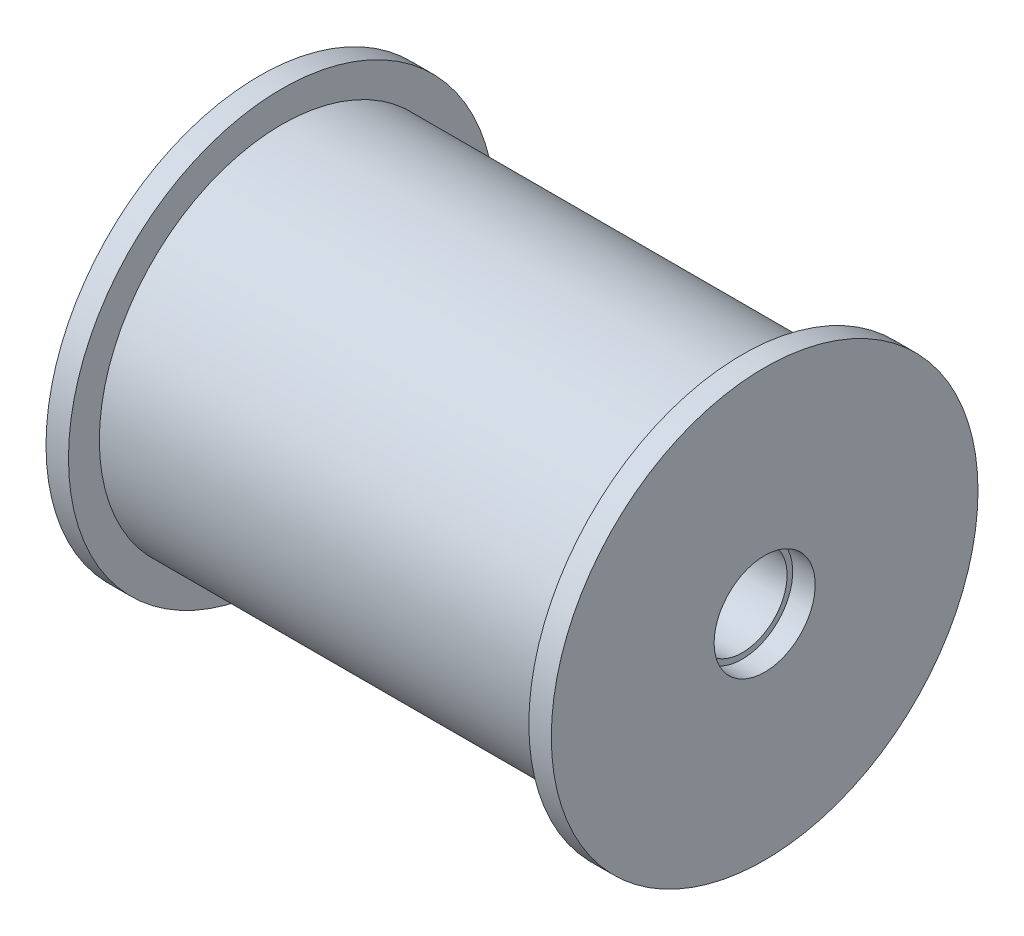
ISO-10303-21;
HEADER;
FILE_DESCRIPTION(('STEP AP214'),'2;1');
FILE_NAME('part.step','',(''),(''),'','','');
FILE_SCHEMA(('AUTOMOTIVE_DESIGN { 1 0 10303 214 1 1 1 1 }'));
ENDSEC;
DATA;
#1=APPLICATION_CONTEXT('core data for automotive mechanical design processes');
#2=APPLICATION_PROTOCOL_DEFINITION('international standard','automotive_design',2000,#1);
#3=PRODUCT_CONTEXT('',#1,'mechanical');
#4=PRODUCT('Part','Part','',(#3));
#5=PRODUCT_RELATED_PRODUCT_CATEGORY('part','',(#4));
#6=PRODUCT_DEFINITION_FORMATION('','',#4);
#7=PRODUCT_DEFINITION_CONTEXT('part definition',#1,'design');
#8=PRODUCT_DEFINITION('design','',#6,#7);
#9=PRODUCT_DEFINITION_SHAPE('','',#8);
#10=(LENGTH_UNIT() NAMED_UNIT(*) SI_UNIT(.MILLI.,.METRE.));
#11=(NAMED_UNIT(*) PLANE_ANGLE_UNIT() SI_UNIT($,.RADIAN.));
#12=(NAMED_UNIT(*) SI_UNIT($,.STERADIAN.) SOLID_ANGLE_UNIT());
#13=UNCERTAINTY_MEASURE_WITH_UNIT(LENGTH_MEASURE(1.E-05),#10,'distance_accuracy_value','');
#14=(GEOMETRIC_REPRESENTATION_CONTEXT(3) GLOBAL_UNCERTAINTY_ASSIGNED_CONTEXT((#13)) GLOBAL_UNIT_ASSIGNED_CONTEXT((#10,
#11,#12)) REPRESENTATION_CONTEXT('',''));
#15=CARTESIAN_POINT('',(0.,0.,0.));
#16=DIRECTION('',(0.,0.,1.));
#17=DIRECTION('',(1.,0.,0.));
#18=AXIS2_PLACEMENT_3D('',#15,#16,#17);
#19=CARTESIAN_POINT('',(-740.,-550.,1185.));
#20=DIRECTION('',(1.,0.,0.));
#21=DIRECTION('',(0.,0.,1.));
#22=AXIS2_PLACEMENT_3D('',#19,#20,#21);
#23=CYLINDRICAL_SURFACE('',#22,76.);
#24=CARTESIAN_POINT('',(-732.,-550.,1185.));
#25=DIRECTION('',(1.,0.,0.));
#26=DIRECTION('',(0.,0.,1.));
#27=AXIS2_PLACEMENT_3D('',#24,#25,#26);
#28=CIRCLE('',#27,76.);
#29=CARTESIAN_POINT('',(-732.,-550.,1261.));
#30=VERTEX_POINT('',#29);
#31=EDGE_CURVE('P0_E10',#30,#30,#28,.T.);
#32=ORIENTED_EDGE('',*,*,#31,.F.);
#33=EDGE_LOOP('',(#32));
#34=FACE_BOUND('',#33,.T.);
#35=CARTESIAN_POINT('',(-740.,-550.,1185.));
#36=DIRECTION('',(1.,0.,0.));
#37=DIRECTION('',(0.,0.,1.));
#38=AXIS2_PLACEMENT_3D('',#35,#36,#37);
#39=CIRCLE('',#38,76.);
#40=CARTESIAN_POINT('',(-740.,-550.,1261.));
#41=VERTEX_POINT('',#40);
#42=EDGE_CURVE('P0_E19',#41,#41,#39,.T.);
#43=ORIENTED_EDGE('',*,*,#42,.T.);
#44=EDGE_LOOP('',(#43));
#45=FACE_BOUND('',#44,.T.);
#46=ADVANCED_FACE('P0_F15',(#34,#45),#23,.T.);
#47=CARTESIAN_POINT('',(-732.,-550.,1185.));
#48=DIRECTION('',(1.,0.,0.));
#49=DIRECTION('',(0.,1.,0.));
#50=AXIS2_PLACEMENT_3D('',#47,#48,#49);
#51=PLANE('',#50);
#52=CARTESIAN_POINT('',(-732.,-550.,1185.));
#53=DIRECTION('',(1.,0.,0.));
#54=DIRECTION('',(0.,0.,1.));
#55=AXIS2_PLACEMENT_3D('',#52,#53,#54);
#56=CIRCLE('',#55,65.);
#57=CARTESIAN_POINT('',(-732.,-550.,1250.));
#58=VERTEX_POINT('',#57);
#59=EDGE_CURVE('P0_E31',#58,#58,#56,.T.);
#60=ORIENTED_EDGE('',*,*,#59,.F.);
#61=EDGE_LOOP('',(#60));
#62=FACE_BOUND('',#61,.T.);
#63=ORIENTED_EDGE('',*,*,#31,.T.);
#64=EDGE_LOOP('',(#63));
#65=FACE_BOUND('',#64,.T.);
#66=ADVANCED_FACE('P0_F17',(#62,#65),#51,.T.);
#67=CARTESIAN_POINT('',(-740.,-550.,1185.));
#68=DIRECTION('',(1.,0.,0.));
#69=DIRECTION('',(0.,1.,0.));
#70=AXIS2_PLACEMENT_3D('',#67,#68,#69);
#71=PLANE('',#70);
#72=CARTESIAN_POINT('',(-740.,-550.,1185.));
#73=DIRECTION('',(1.,0.,0.));
#74=DIRECTION('',(0.,0.,1.));
#75=AXIS2_PLACEMENT_3D('',#72,#73,#74);
#76=CIRCLE('',#75,18.);
#77=CARTESIAN_POINT('',(-740.,-550.,1203.));
#78=VERTEX_POINT('',#77);
#79=EDGE_CURVE('P0_E40',#78,#78,#76,.T.);
#80=ORIENTED_EDGE('',*,*,#79,.T.);
#81=EDGE_LOOP('',(#80));
#82=FACE_BOUND('',#81,.T.);
#83=ORIENTED_EDGE('',*,*,#42,.F.);
#84=EDGE_LOOP('',(#83));
#85=FACE_BOUND('',#84,.T.);
#86=ADVANCED_FACE('P0_F95',(#82,#85),#71,.F.);
#87=CARTESIAN_POINT('',(-732.,-550.,1185.));
#88=DIRECTION('',(1.,0.,0.));
#89=DIRECTION('',(0.,0.,1.));
#90=AXIS2_PLACEMENT_3D('',#87,#88,#89);
#91=CYLINDRICAL_SURFACE('',#90,65.);
#92=CARTESIAN_POINT('',(-568.,-550.,1185.));
#93=DIRECTION('',(1.,0.,0.));
#94=DIRECTION('',(0.,0.,1.));
#95=AXIS2_PLACEMENT_3D('',#92,#93,#94);
#96=CIRCLE('',#95,65.);
#97=CARTESIAN_POINT('',(-568.,-550.,1250.));
#98=VERTEX_POINT('',#97);
#99=EDGE_CURVE('P0_E34',#98,#98,#96,.T.);
#100=ORIENTED_EDGE('',*,*,#99,.F.);
#101=EDGE_LOOP('',(#100));
#102=FACE_BOUND('',#101,.T.);
#103=ORIENTED_EDGE('',*,*,#59,.T.);
#104=EDGE_LOOP('',(#103));
#105=FACE_BOUND('',#104,.T.);
#106=ADVANCED_FACE('P0_F83',(#102,#105),#91,.T.);
#107=CARTESIAN_POINT('',(-742.,-550.,1185.));
#108=DIRECTION('',(1.,0.,0.));
#109=DIRECTION('',(0.,0.,1.));
#110=AXIS2_PLACEMENT_3D('',#107,#108,#109);
#111=CYLINDRICAL_SURFACE('',#110,18.);
#112=CARTESIAN_POINT('',(-560.,-550.,1185.));
#113=DIRECTION('',(1.,0.,0.));
#114=DIRECTION('',(0.,0.,1.));
#115=AXIS2_PLACEMENT_3D('',#112,#113,#114);
#116=CIRCLE('',#115,18.);
#117=CARTESIAN_POINT('',(-560.,-550.,1203.));
#118=VERTEX_POINT('',#117);
#119=EDGE_CURVE('P0_E46',#118,#118,#116,.T.);
#120=ORIENTED_EDGE('',*,*,#119,.T.);
#121=EDGE_LOOP('',(#120));
#122=FACE_BOUND('',#121,.T.);
#123=ORIENTED_EDGE('',*,*,#79,.F.);
#124=EDGE_LOOP('',(#123));
#125=FACE_BOUND('',#124,.T.);
#126=ADVANCED_FACE('P0_F76',(#122,#125),#111,.F.);
#127=CARTESIAN_POINT('',(-568.,-550.,1185.));
#128=DIRECTION('',(1.,0.,0.));
#129=DIRECTION('',(0.,1.,0.));
#130=AXIS2_PLACEMENT_3D('',#127,#128,#129);
#131=PLANE('',#130);
#132=ORIENTED_EDGE('',*,*,#99,.T.);
#133=EDGE_LOOP('',(#132));
#134=FACE_BOUND('',#133,.T.);
#135=CARTESIAN_POINT('',(-568.,-550.,1185.));
#136=DIRECTION('',(1.,0.,0.));
#137=DIRECTION('',(0.,0.,1.));
#138=AXIS2_PLACEMENT_3D('',#135,#136,#137);
#139=CIRCLE('',#138,76.);
#140=CARTESIAN_POINT('',(-568.,-550.,1261.));
#141=VERTEX_POINT('',#140);
#142=EDGE_CURVE('P0_E55',#141,#141,#139,.T.);
#143=ORIENTED_EDGE('',*,*,#142,.F.);
#144=EDGE_LOOP('',(#143));
#145=FACE_BOUND('',#144,.T.);
#146=ADVANCED_FACE('P0_F72',(#134,#145),#131,.F.);
#147=CARTESIAN_POINT('',(-560.,-550.,1185.));
#148=DIRECTION('',(1.,0.,0.));
#149=DIRECTION('',(0.,1.,0.));
#150=AXIS2_PLACEMENT_3D('',#147,#148,#149);
#151=PLANE('',#150);
#152=ORIENTED_EDGE('',*,*,#119,.F.);
#153=EDGE_LOOP('',(#152));
#154=FACE_BOUND('',#153,.T.);
#155=CARTESIAN_POINT('',(-560.,-550.,1185.));
#156=DIRECTION('',(1.,0.,0.));
#157=DIRECTION('',(0.,0.,1.));
#158=AXIS2_PLACEMENT_3D('',#155,#156,#157);
#159=CIRCLE('',#158,76.);
#160=CARTESIAN_POINT('',(-560.,-550.,1261.));
#161=VERTEX_POINT('',#160);
#162=EDGE_CURVE('P0_E59',#161,#161,#159,.T.);
#163=ORIENTED_EDGE('',*,*,#162,.T.);
#164=EDGE_LOOP('',(#163));
#165=FACE_BOUND('',#164,.T.);
#166=ADVANCED_FACE('P0_F66',(#154,#165),#151,.T.);
#167=CARTESIAN_POINT('',(-568.,-550.,1185.));
#168=DIRECTION('',(1.,0.,0.));
#169=DIRECTION('',(0.,0.,1.));
#170=AXIS2_PLACEMENT_3D('',#167,#168,#169);
#171=CYLINDRICAL_SURFACE('',#170,76.);
#172=ORIENTED_EDGE('',*,*,#162,.F.);
#173=EDGE_LOOP('',(#172));
#174=FACE_BOUND('',#173,.T.);
#175=ORIENTED_EDGE('',*,*,#142,.T.);
#176=EDGE_LOOP('',(#175));
#177=FACE_BOUND('',#176,.T.);
#178=ADVANCED_FACE('P0_F68',(#174,#177),#171,.T.);
#179=CLOSED_SHELL('',(#46,#66,#86,#106,#126,#146,#166,#178));
#180=MANIFOLD_SOLID_BREP('P0_B1',#179);
#181=CARTESIAN_POINT('',(-733.,-550.,1185.));
#182=DIRECTION('',(1.,0.,0.));
#183=DIRECTION('',(0.,0.,1.));
#184=AXIS2_PLACEMENT_3D('',#181,#182,#183);
#185=CYLINDRICAL_SURFACE('',#184,16.);
#186=CARTESIAN_POINT('',(-702.,-550.,1185.));
#187=DIRECTION('',(1.,0.,0.));
#188=DIRECTION('',(0.,0.,1.));
#189=AXIS2_PLACEMENT_3D('',#186,#187,#188);
#190=CIRCLE('',#189,16.);
#191=CARTESIAN_POINT('',(-702.,-550.,1201.));
#192=VERTEX_POINT('',#191);
#193=EDGE_CURVE('P1_E22',#192,#192,#190,.T.);
#194=ORIENTED_EDGE('',*,*,#193,.T.);
#195=EDGE_LOOP('',(#194));
#196=FACE_BOUND('',#195,.T.);
#197=CARTESIAN_POINT('',(-732.,-550.,1185.));
#198=DIRECTION('',(1.,0.,0.));
#199=DIRECTION('',(0.,0.,1.));
#200=AXIS2_PLACEMENT_3D('',#197,#198,#199);
#201=CIRCLE('',#200,16.);
#202=CARTESIAN_POINT('',(-732.,-550.,1201.));
#203=VERTEX_POINT('',#202);
#204=EDGE_CURVE('P1_E10',#203,#203,#201,.T.);
#205=ORIENTED_EDGE('',*,*,#204,.F.);
#206=EDGE_LOOP('',(#205));
#207=FACE_BOUND('',#206,.T.);
#208=ADVANCED_FACE('P1_F15',(#196,#207),#185,.F.);
#209=CARTESIAN_POINT('',(-732.,-550.,1185.));
#210=DIRECTION('',(1.,0.,0.));
#211=DIRECTION('',(0.,1.,0.));
#212=AXIS2_PLACEMENT_3D('',#209,#210,#211);
#213=PLANE('',#212);
#214=ORIENTED_EDGE('',*,*,#204,.T.);
#215=EDGE_LOOP('',(#214));
#216=FACE_BOUND('',#215,.T.);
#217=CARTESIAN_POINT('',(-732.,-550.,1185.));
#218=DIRECTION('',(1.,0.,0.));
#219=DIRECTION('',(0.,0.,1.));
#220=AXIS2_PLACEMENT_3D('',#217,#218,#219);
#221=CIRCLE('',#220,18.);
#222=CARTESIAN_POINT('',(-732.,-550.,1203.));
#223=VERTEX_POINT('',#222);
#224=EDGE_CURVE('P1_E28',#223,#223,#221,.T.);
#225=ORIENTED_EDGE('',*,*,#224,.F.);
#226=EDGE_LOOP('',(#225));
#227=FACE_BOUND('',#226,.T.);
#228=ADVANCED_FACE('P1_F55',(#216,#227),#213,.F.);
#229=CARTESIAN_POINT('',(-702.,-550.,1185.));
#230=DIRECTION('',(1.,0.,0.));
#231=DIRECTION('',(0.,1.,0.));
#232=AXIS2_PLACEMENT_3D('',#229,#230,#231);
#233=PLANE('',#232);
#234=ORIENTED_EDGE('',*,*,#193,.F.);
#235=EDGE_LOOP('',(#234));
#236=FACE_BOUND('',#235,.T.);
#237=CARTESIAN_POINT('',(-702.,-550.,1185.));
#238=DIRECTION('',(1.,0.,0.));
#239=DIRECTION('',(0.,0.,1.));
#240=AXIS2_PLACEMENT_3D('',#237,#238,#239);
#241=CIRCLE('',#240,18.);
#242=CARTESIAN_POINT('',(-702.,-550.,1203.));
#243=VERTEX_POINT('',#242);
#244=EDGE_CURVE('P1_E38',#243,#243,#241,.T.);
#245=ORIENTED_EDGE('',*,*,#244,.T.);
#246=EDGE_LOOP('',(#245));
#247=FACE_BOUND('',#246,.T.);
#248=ADVANCED_FACE('P1_F42',(#236,#247),#233,.T.);
#249=CARTESIAN_POINT('',(-732.,-550.,1185.));
#250=DIRECTION('',(1.,0.,0.));
#251=DIRECTION('',(0.,0.,1.));
#252=AXIS2_PLACEMENT_3D('',#249,#250,#251);
#253=CYLINDRICAL_SURFACE('',#252,18.);
#254=ORIENTED_EDGE('',*,*,#244,.F.);
#255=EDGE_LOOP('',(#254));
#256=FACE_BOUND('',#255,.T.);
#257=ORIENTED_EDGE('',*,*,#224,.T.);
#258=EDGE_LOOP('',(#257));
#259=FACE_BOUND('',#258,.T.);
#260=ADVANCED_FACE('P1_F46',(#256,#259),#253,.T.);
#261=CLOSED_SHELL('',(#208,#228,#248,#260));
#262=MANIFOLD_SOLID_BREP('P1_B1',#261);
#263=CARTESIAN_POINT('',(-599.,-550.,1185.));
#264=DIRECTION('',(1.,0.,0.));
#265=DIRECTION('',(0.,0.,1.));
#266=AXIS2_PLACEMENT_3D('',#263,#264,#265);
#267=CYLINDRICAL_SURFACE('',#266,16.);
#268=CARTESIAN_POINT('',(-568.,-550.,1185.));
#269=DIRECTION('',(1.,0.,0.));
#270=DIRECTION('',(0.,0.,1.));
#271=AXIS2_PLACEMENT_3D('',#268,#269,#270);
#272=CIRCLE('',#271,16.);
#273=CARTESIAN_POINT('',(-568.,-550.,1201.));
#274=VERTEX_POINT('',#273);
#275=EDGE_CURVE('P2_E17',#274,#274,#272,.T.);
#276=ORIENTED_EDGE('',*,*,#275,.T.);
#277=EDGE_LOOP('',(#276));
#278=FACE_BOUND('',#277,.T.);
#279=CARTESIAN_POINT('',(-598.,-550.,1185.));
#280=DIRECTION('',(1.,0.,0.));
#281=DIRECTION('',(0.,0.,1.));
#282=AXIS2_PLACEMENT_3D('',#279,#280,#281);
#283=CIRCLE('',#282,16.);
#284=CARTESIAN_POINT('',(-598.,-550.,1201.));
#285=VERTEX_POINT('',#284);
#286=EDGE_CURVE('P2_E9',#285,#285,#283,.T.);
#287=ORIENTED_EDGE('',*,*,#286,.F.);
#288=EDGE_LOOP('',(#287));
#289=FACE_BOUND('',#288,.T.);
#290=ADVANCED_FACE('P2_F14',(#278,#289),#267,.F.);
#291=CARTESIAN_POINT('',(-598.,-550.,1185.));
#292=DIRECTION('',(1.,0.,0.));
#293=DIRECTION('',(0.,1.,0.));
#294=AXIS2_PLACEMENT_3D('',#291,#292,#293);
#295=PLANE('',#294);
#296=ORIENTED_EDGE('',*,*,#286,.T.);
#297=EDGE_LOOP('',(#296));
#298=FACE_BOUND('',#297,.T.);
#299=CARTESIAN_POINT('',(-598.,-550.,1185.));
#300=DIRECTION('',(1.,0.,0.));
#301=DIRECTION('',(0.,0.,1.));
#302=AXIS2_PLACEMENT_3D('',#299,#300,#301);
#303=CIRCLE('',#302,18.);
#304=CARTESIAN_POINT('',(-598.,-550.,1203.));
#305=VERTEX_POINT('',#304);
#306=EDGE_CURVE('P2_E26',#305,#305,#303,.T.);
#307=ORIENTED_EDGE('',*,*,#306,.F.);
#308=EDGE_LOOP('',(#307));
#309=FACE_BOUND('',#308,.T.);
#310=ADVANCED_FACE('P2_F41',(#298,#309),#295,.F.);
#311=CARTESIAN_POINT('',(-568.,-550.,1185.));
#312=DIRECTION('',(1.,0.,0.));
#313=DIRECTION('',(0.,1.,0.));
#314=AXIS2_PLACEMENT_3D('',#311,#312,#313);
#315=PLANE('',#314);
#316=ORIENTED_EDGE('',*,*,#275,.F.);
#317=EDGE_LOOP('',(#316));
#318=FACE_BOUND('',#317,.T.);
#319=CARTESIAN_POINT('',(-568.,-550.,1185.));
#320=DIRECTION('',(1.,0.,0.));
#321=DIRECTION('',(0.,0.,1.));
#322=AXIS2_PLACEMENT_3D('',#319,#320,#321);
#323=CIRCLE('',#322,18.);
#324=CARTESIAN_POINT('',(-568.,-550.,1203.));
#325=VERTEX_POINT('',#324);
#326=EDGE_CURVE('P2_E33',#325,#325,#323,.T.);
#327=ORIENTED_EDGE('',*,*,#326,.T.);
#328=EDGE_LOOP('',(#327));
#329=FACE_BOUND('',#328,.T.);
#330=ADVANCED_FACE('P2_F43',(#318,#329),#315,.T.);
#331=CARTESIAN_POINT('',(-598.,-550.,1185.));
#332=DIRECTION('',(1.,0.,0.));
#333=DIRECTION('',(0.,0.,1.));
#334=AXIS2_PLACEMENT_3D('',#331,#332,#333);
#335=CYLINDRICAL_SURFACE('',#334,18.);
#336=ORIENTED_EDGE('',*,*,#326,.F.);
#337=EDGE_LOOP('',(#336));
#338=FACE_BOUND('',#337,.T.);
#339=ORIENTED_EDGE('',*,*,#306,.T.);
#340=EDGE_LOOP('',(#339));
#341=FACE_BOUND('',#340,.T.);
#342=ADVANCED_FACE('P2_F39',(#338,#341),#335,.T.);
#343=CLOSED_SHELL('',(#290,#310,#330,#342));
#344=MANIFOLD_SOLID_BREP('P2_B1',#343);
#345=ADVANCED_BREP_SHAPE_REPRESENTATION('',(#18,#180,#262,#344),#14);
#346=SHAPE_DEFINITION_REPRESENTATION(#9,#345);
ENDSEC;
END-ISO-10303-21;
